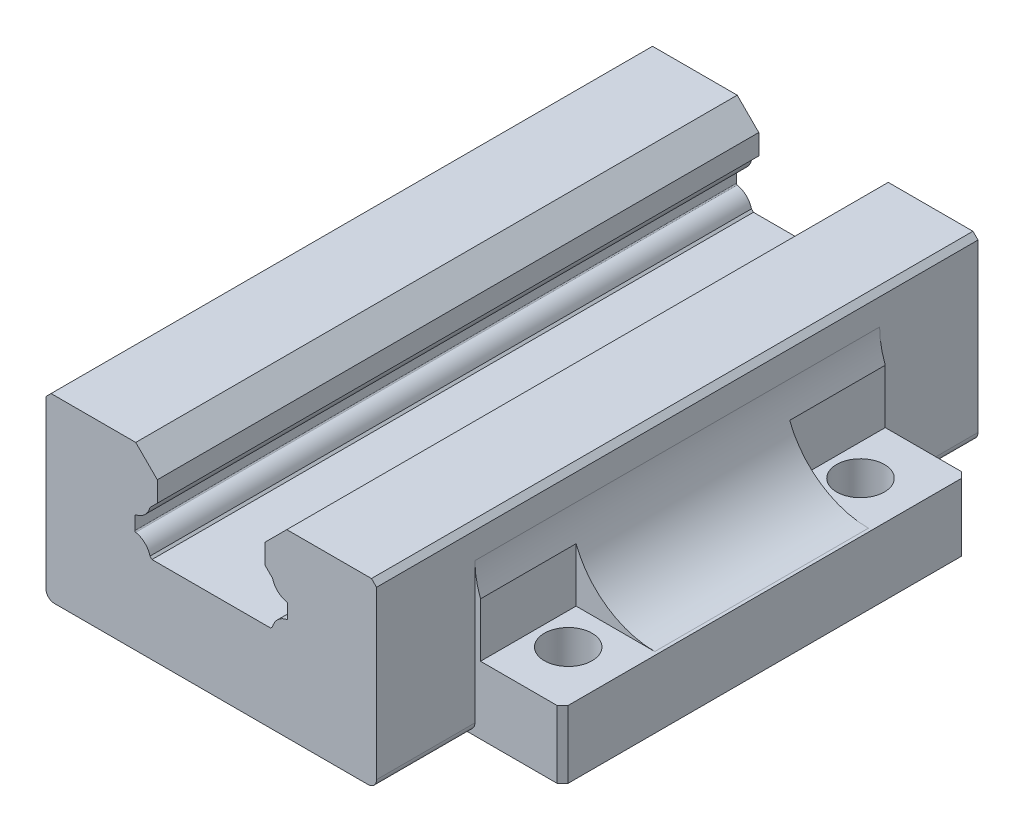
from build123d import *

# Parameters (mm, degrees)
LINEAR_AUSTRAGEN1_DEPTH      = 53.5
LINEAR_AUSTRAGEN1_DEPTH_BACK = 53.5
SKIZZE4_W                    = 90
SKIZZE4_H                    = 72
LINEAR_AUSTRAGEN2_DEPTH      = 11.5
LINEAR_AUSTRAGEN5_DEPTH      = 72
FASE1_SIZE                   = 1
SKIZZE6_W                    = 20
SKIZZE6_H                    = 72
LINEAR_AUSTRAGEN3_DEPTH      = 0.5
SKIZZE7_W                    = 14.9999885
SKIZZE7_H                    = 72
SKIZZE7_W_2                  = 15.0000115
LINEAR_AUSTRAGEN4_DEPTH      = 0.25
M10_GEWINDEBOHRUNG3_D        = 8.5
SKIZZE15_W                   = 17
SKIZZE15_H                   = 15
LINEAR_AUSTRAGEN6_DEPTH      = 14.6


with BuildPart() as part:
    # Skizze3 → Linear austragen1 (new, two sides: drawn at the far end of the back side and taken through both)
    with BuildSketch(Plane.XY.offset(-LINEAR_AUSTRAGEN1_DEPTH_BACK)):
        with BuildLine():
            Line((-28.5000115, 32.049988), (-29.4, 31.1499995))
            Line((-29.4, 31.1499995), (-29.4, 1.5))
            ThreePointArc((-29.4, 1.5), (-28.960656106, 0.439335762), (-27.8999885, 0))
            Line((-27.8999885, 0), (27.8999885, 0))
            ThreePointArc((27.8999885, 0), (28.960648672, 0.439339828), (29.3999885, 1.5))
            Line((29.3999885, 1.5), (29.3999885, 31.149988))
            Line((29.3999885, 31.149988), (28.4999885, 32.049988))
            Line((28.4999885, 32.049988), (13.434291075, 32.049988))
            Line((13.434291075, 32.049988), (9.5999885, 28.215685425))
            Line((9.5999885, 28.215685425), (9.5999885, 24.595753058))
            Line((9.5999885, 24.595753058), (10.898770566, 23.296970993))
            ThreePointArc((10.898770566, 23.296970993), (11.824335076, 21.733088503), (13.439074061, 20.899412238))
            ThreePointArc((13.439074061, 20.899412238), (13.554612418, 20.830120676), (13.5999885, 20.70326862))
            Line((13.5999885, 20.70326862), (13.5999885, 18.39674436))
            ThreePointArc((13.5999885, 18.39674436), (13.554612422, 18.269892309), (13.439074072, 18.200600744))
            ThreePointArc((13.439074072, 18.200600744), (11.824336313, 17.36692529), (10.898771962, 15.803044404))
            Line((10.898771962, 15.803044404), (10.545727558, 15.45))
            Line((10.545727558, 15.45), (-10.545750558, 15.45))
            Line((-10.545750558, 15.45), (-10.898794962, 15.803044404))
            ThreePointArc((-10.898794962, 15.803044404), (-11.824359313, 17.36692529), (-13.439097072, 18.200600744))
            ThreePointArc((-13.439097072, 18.200600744), (-13.554635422, 18.269892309), (-13.6000115, 18.39674436))
            Line((-13.6000115, 18.39674436), (-13.6000115, 20.70326862))
            ThreePointArc((-13.6000115, 20.70326862), (-13.554635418, 20.830120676), (-13.439097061, 20.899412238))
            ThreePointArc((-13.439097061, 20.899412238), (-11.824358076, 21.733088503), (-10.898793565, 23.296970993))
            Line((-10.898793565, 23.296970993), (-9.6000115, 24.595753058))
            Line((-9.6000115, 24.595753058), (-9.6000115, 28.215685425))
            Line((-9.6000115, 28.215685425), (-13.434314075, 32.049988))
            Line((-13.434314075, 32.049988), (-28.5000115, 32.049988))
        make_face()
    extrude(amount=LINEAR_AUSTRAGEN1_DEPTH + LINEAR_AUSTRAGEN1_DEPTH_BACK)

    # Skizze4 → Linear austragen2 (add)
    with BuildSketch(Plane.XZ):
        Rectangle(SKIZZE4_W, SKIZZE4_H)
    extrude(amount=-LINEAR_AUSTRAGEN2_DEPTH)

    # Skizze12 → Linear austragen5 (add)
    with BuildSketch(Plane.XY.offset(36)):
        with BuildLine():
            Line((29.3999885, 11.5), (29.3999885, 26.5))
            ThreePointArc((29.3999885, 26.5), (33.793386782, 15.893398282), (44.3999885, 11.5))
            Line((44.3999885, 11.5), (29.3999885, 11.5))
        make_face()
        with BuildLine():
            Line((-44.3999885, 11.5), (-29.3999885, 11.5))
            Line((-29.3999885, 11.5), (-29.3999885, 26.5))
            ThreePointArc((-29.3999885, 26.5), (-33.793386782, 15.893398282), (-44.3999885, 11.5))
        make_face()
    extrude(amount=-LINEAR_AUSTRAGEN5_DEPTH)

    # Fase1
    fase1_edges = [part.edges().sort_by_distance(p)[0] for p in [
        (-45, 5.75, -36),
        (-45, 5.75, 36),
        (45, 5.75, -36),
        (45, 5.75, 36),
    ]]
    chamfer(fase1_edges, length=FASE1_SIZE)

    # Skizze6 → Linear austragen3 (add)
    with BuildSketch(Plane.XZ):
        Polygon((45, -35), (45, 35), (44, 36), (25, 36), (25, -36), (44, -36), align=None)
        Polygon((-45, 35), (-45, -35), (-44, -36), (-25, -36), (-25, 36), (-44, 36), align=None)
        with Locations((-1.15e-05, 0)):
            Rectangle(SKIZZE6_W, SKIZZE6_H)
    extrude(amount=LINEAR_AUSTRAGEN3_DEPTH)

    # Skizze7 → Linear austragen4 (add)
    with BuildSketch(Plane.XZ):
        with Locations((-17.50000575, 0)):
            Rectangle(SKIZZE7_W, SKIZZE7_H)
        with Locations((17.49999425, 0)):
            Rectangle(SKIZZE7_W_2, SKIZZE7_H)
    extrude(amount=LINEAR_AUSTRAGEN4_DEPTH)

    # M10 Gewindebohrung3 (through all)
    with Locations(Plane(origin=(-36, -0.5, 26), x_dir=(-1, 0, 0), z_dir=(0, -1, 0))):
        with Locations((0, 0), (0, 52), (-72, 0), (-72, 52)):
            Hole(M10_GEWINDEBOHRUNG3_D / 2)

    # Skizze15 → Linear austragen6 (cut)
    with BuildSketch(Plane(origin=(45, 0, 0), x_dir=(0, 0, -1), z_dir=(1, 0, 0))):
        with Locations((27.5, 19)):
            Rectangle(SKIZZE15_W, SKIZZE15_H)
        with Locations((-27.5, 19)):
            Rectangle(SKIZZE15_W, SKIZZE15_H)
    linear_austragen6 = extrude(amount=-LINEAR_AUSTRAGEN6_DEPTH, mode=Mode.SUBTRACT)

    # Spiegeln1: Linear austragen6 across plane
    add(linear_austragen6.mirror(Plane(origin=(0, 0, 0), x_dir=(0, 0, 1), z_dir=(1, 0, 0))), mode=Mode.SUBTRACT)


solid = part.part
